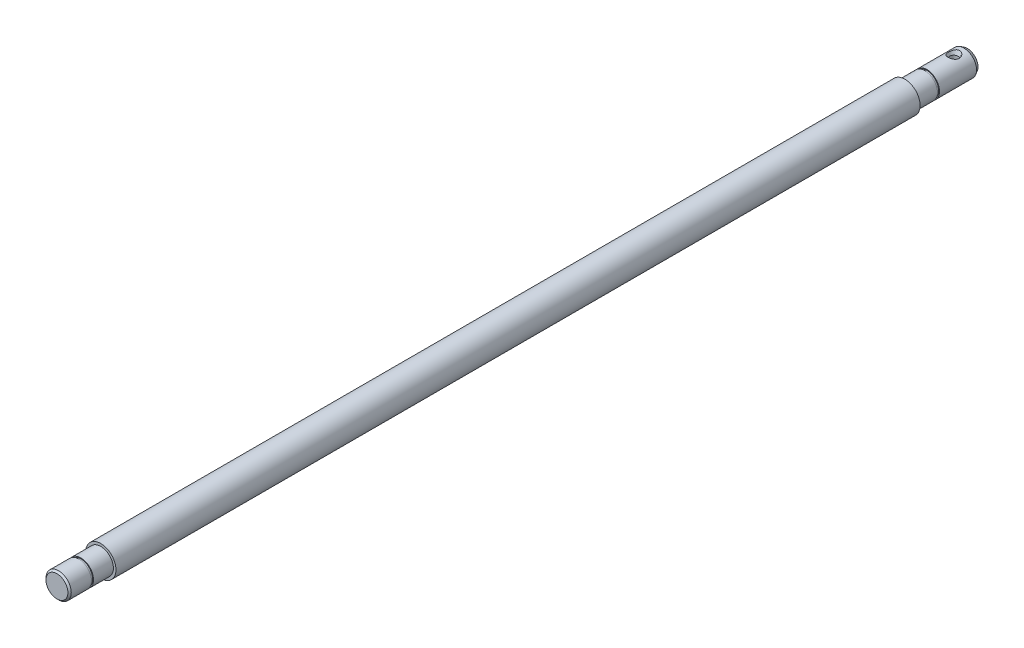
ISO-10303-21;
HEADER;
FILE_DESCRIPTION(('STEP AP214'),'2;1');
FILE_NAME('part.step','',(''),(''),'','','');
FILE_SCHEMA(('AUTOMOTIVE_DESIGN { 1 0 10303 214 1 1 1 1 }'));
ENDSEC;
DATA;
#1=APPLICATION_CONTEXT('core data for automotive mechanical design processes');
#2=APPLICATION_PROTOCOL_DEFINITION('international standard','automotive_design',2000,#1);
#3=PRODUCT_CONTEXT('',#1,'mechanical');
#4=PRODUCT('Part','Part','',(#3));
#5=PRODUCT_RELATED_PRODUCT_CATEGORY('part','',(#4));
#6=PRODUCT_DEFINITION_FORMATION('','',#4);
#7=PRODUCT_DEFINITION_CONTEXT('part definition',#1,'design');
#8=PRODUCT_DEFINITION('design','',#6,#7);
#9=PRODUCT_DEFINITION_SHAPE('','',#8);
#10=(LENGTH_UNIT() NAMED_UNIT(*) SI_UNIT(.MILLI.,.METRE.));
#11=(NAMED_UNIT(*) PLANE_ANGLE_UNIT() SI_UNIT($,.RADIAN.));
#12=(NAMED_UNIT(*) SI_UNIT($,.STERADIAN.) SOLID_ANGLE_UNIT());
#13=UNCERTAINTY_MEASURE_WITH_UNIT(LENGTH_MEASURE(1.E-05),#10,'distance_accuracy_value','');
#14=(GEOMETRIC_REPRESENTATION_CONTEXT(3) GLOBAL_UNCERTAINTY_ASSIGNED_CONTEXT((#13)) GLOBAL_UNIT_ASSIGNED_CONTEXT((#10,
#11,#12)) REPRESENTATION_CONTEXT('',''));
#15=CARTESIAN_POINT('',(0.,0.,0.));
#16=DIRECTION('',(0.,0.,1.));
#17=DIRECTION('',(1.,0.,0.));
#18=AXIS2_PLACEMENT_3D('',#15,#16,#17);
#19=CARTESIAN_POINT('',(0.,0.,540.));
#20=DIRECTION('',(0.,0.,-1.));
#21=DIRECTION('',(-1.,0.,0.));
#22=AXIS2_PLACEMENT_3D('',#19,#20,#21);
#23=CYLINDRICAL_SURFACE('',#22,7.5);
#24=CARTESIAN_POINT('',(0.,0.,37.));
#25=DIRECTION('',(0.,0.,-1.));
#26=DIRECTION('',(-1.,0.,0.));
#27=AXIS2_PLACEMENT_3D('',#24,#25,#26);
#28=CIRCLE('',#27,7.5);
#29=CARTESIAN_POINT('',(-7.5,0.,37.));
#30=VERTEX_POINT('',#29);
#31=EDGE_CURVE('E52',#30,#30,#28,.T.);
#32=ORIENTED_EDGE('',*,*,#31,.T.);
#33=EDGE_LOOP('',(#32));
#34=FACE_BOUND('',#33,.T.);
#35=CARTESIAN_POINT('',(0.,0.,25.2));
#36=DIRECTION('',(0.,0.,-1.));
#37=DIRECTION('',(-1.,0.,0.));
#38=AXIS2_PLACEMENT_3D('',#35,#36,#37);
#39=CIRCLE('',#38,7.5);
#40=CARTESIAN_POINT('',(-7.5,0.,25.2));
#41=VERTEX_POINT('',#40);
#42=EDGE_CURVE('E175',#41,#41,#39,.T.);
#43=ORIENTED_EDGE('',*,*,#42,.F.);
#44=EDGE_LOOP('',(#43));
#45=FACE_BOUND('',#44,.T.);
#46=ADVANCED_FACE('F34',(#34,#45),#23,.T.);
#47=CARTESIAN_POINT('',(0.,0.,2.));
#48=DIRECTION('',(0.,0.,1.));
#49=DIRECTION('',(1.,0.,0.));
#50=AXIS2_PLACEMENT_3D('',#47,#48,#49);
#51=CIRCLE('',#50,7.5);
#52=CARTESIAN_POINT('',(7.5,0.,2.));
#53=VERTEX_POINT('',#52);
#54=EDGE_CURVE('E166',#53,#53,#51,.T.);
#55=ORIENTED_EDGE('',*,*,#54,.T.);
#56=EDGE_LOOP('',(#55));
#57=FACE_BOUND('',#56,.T.);
#58=CARTESIAN_POINT('',(-2.37306753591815,-7.11467190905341,5.64909261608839));
#59=CARTESIAN_POINT('',(-2.50121158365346,-7.07193088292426,5.80360555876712));
#60=CARTESIAN_POINT('',(-2.6158120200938,-7.02986523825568,5.96956594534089));
#61=CARTESIAN_POINT('',(-2.81591307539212,-6.95213613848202,6.31953074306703));
#62=CARTESIAN_POINT('',(-2.90141119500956,-6.91647323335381,6.50353670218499));
#63=CARTESIAN_POINT('',(-3.04098717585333,-6.85624986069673,6.88315832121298));
#64=CARTESIAN_POINT('',(-3.09530860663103,-6.83160366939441,7.07867044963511));
#65=CARTESIAN_POINT('',(-3.17208576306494,-6.79630034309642,7.47702752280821));
#66=CARTESIAN_POINT('',(-3.19455717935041,-6.78563632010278,7.67986880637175));
#67=CARTESIAN_POINT('',(-3.20679414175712,-6.77986041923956,8.08112233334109));
#68=CARTESIAN_POINT('',(-3.1974472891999,-6.78432645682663,8.27950186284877));
#69=CARTESIAN_POINT('',(-3.14829126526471,-6.80727397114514,8.671622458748));
#70=CARTESIAN_POINT('',(-3.10847828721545,-6.82575719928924,8.86536294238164));
#71=CARTESIAN_POINT('',(-2.99998724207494,-6.87412053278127,9.24111950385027));
#72=CARTESIAN_POINT('',(-2.93157227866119,-6.90389653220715,9.42322543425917));
#73=CARTESIAN_POINT('',(-2.76736656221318,-6.97133665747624,9.77312274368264));
#74=CARTESIAN_POINT('',(-2.67156566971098,-7.00900370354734,9.94090879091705));
#75=CARTESIAN_POINT('',(-2.45019952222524,-7.08949046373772,10.2637537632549));
#76=CARTESIAN_POINT('',(-2.32367261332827,-7.13244837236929,10.4181214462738));
#77=CARTESIAN_POINT('',(-2.04493399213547,-7.21729993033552,10.7021343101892));
#78=CARTESIAN_POINT('',(-1.89272280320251,-7.25919360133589,10.8317799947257));
#79=CARTESIAN_POINT('',(-1.57132075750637,-7.33534097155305,11.0569693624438));
#80=CARTESIAN_POINT('',(-1.40291512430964,-7.3698115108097,11.1535518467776));
#81=CARTESIAN_POINT('',(-1.04938107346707,-7.42837229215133,11.313510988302));
#82=CARTESIAN_POINT('',(-0.864275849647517,-7.45247667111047,11.3769328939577));
#83=CARTESIAN_POINT('',(-0.508927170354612,-7.48455525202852,11.4604997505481));
#84=CARTESIAN_POINT('',(-0.339910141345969,-7.49422789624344,11.485223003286));
#85=CARTESIAN_POINT('',(8.58694290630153E-05,-7.50192226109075,11.5049269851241));
#86=CARTESIAN_POINT('',(0.171063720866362,-7.49995038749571,11.4999240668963));
#87=CARTESIAN_POINT('',(0.493511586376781,-7.48532783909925,11.4623484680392));
#88=CARTESIAN_POINT('',(0.645336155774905,-7.47366979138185,11.4323377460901));
#89=CARTESIAN_POINT('',(0.941719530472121,-7.44213572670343,11.34956667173));
#90=CARTESIAN_POINT('',(1.08627758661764,-7.42225886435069,11.296803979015));
#91=CARTESIAN_POINT('',(1.36989431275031,-7.37528303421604,11.168505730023));
#92=CARTESIAN_POINT('',(1.50857823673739,-7.34795371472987,11.0922314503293));
#93=CARTESIAN_POINT('',(1.77235436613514,-7.28883149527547,10.9204083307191));
#94=CARTESIAN_POINT('',(1.89744091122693,-7.25703674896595,10.8248515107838));
#95=CARTESIAN_POINT('',(2.14650497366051,-7.18757188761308,10.6046114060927));
#96=CARTESIAN_POINT('',(2.26853757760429,-7.14965517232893,10.4778068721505));
#97=CARTESIAN_POINT('',(2.49185161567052,-7.07492548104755,10.2067644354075));
#98=CARTESIAN_POINT('',(2.5931206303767,-7.03811317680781,10.0625161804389));
#99=CARTESIAN_POINT('',(2.78353264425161,-6.96516210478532,9.74306161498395));
#100=CARTESIAN_POINT('',(2.87010603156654,-6.9295455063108,9.56619556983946));
#101=CARTESIAN_POINT('',(3.01432345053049,-6.86804448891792,9.19944803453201));
#102=CARTESIAN_POINT('',(3.0719680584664,-6.84215987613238,9.00956680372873));
#103=CARTESIAN_POINT('',(3.15757501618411,-6.80308819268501,8.61877759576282));
#104=CARTESIAN_POINT('',(3.18506185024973,-6.79010483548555,8.4177440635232));
#105=CARTESIAN_POINT('',(3.20786524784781,-6.77936394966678,8.01348346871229));
#106=CARTESIAN_POINT('',(3.2031889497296,-6.78160304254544,7.81025690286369));
#107=CARTESIAN_POINT('',(3.16256416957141,-6.8006350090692,7.41481296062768));
#108=CARTESIAN_POINT('',(3.12770147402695,-6.8169224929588,7.2224577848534));
#109=CARTESIAN_POINT('',(3.02912924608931,-6.86128775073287,6.84670045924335));
#110=CARTESIAN_POINT('',(2.96541290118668,-6.88936830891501,6.66330043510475));
#111=CARTESIAN_POINT('',(2.80910426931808,-6.95458173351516,6.30679167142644));
#112=CARTESIAN_POINT('',(2.71599528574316,-6.99187375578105,6.13393886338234));
#113=CARTESIAN_POINT('',(2.50294163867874,-7.07093881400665,5.80667042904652));
#114=CARTESIAN_POINT('',(2.38298609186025,-7.11271366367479,5.65226231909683));
#115=CARTESIAN_POINT('',(2.11524580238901,-7.1969305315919,5.3633289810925));
#116=CARTESIAN_POINT('',(1.96692109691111,-7.23936772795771,5.22929920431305));
#117=CARTESIAN_POINT('',(1.64702623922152,-7.31877036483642,4.99051652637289));
#118=CARTESIAN_POINT('',(1.47547249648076,-7.35573962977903,4.88574311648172));
#119=CARTESIAN_POINT('',(1.12883644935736,-7.41645875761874,4.71849516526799));
#120=CARTESIAN_POINT('',(0.955300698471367,-7.4410666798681,4.65317686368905));
#121=CARTESIAN_POINT('',(0.68754521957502,-7.46896259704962,4.58005309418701));
#122=CARTESIAN_POINT('',(0.597046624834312,-7.47675874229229,4.55982038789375));
#123=CARTESIAN_POINT('',(0.414341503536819,-7.4891055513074,4.52791939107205));
#124=CARTESIAN_POINT('',(0.322135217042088,-7.49365666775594,4.51624990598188));
#125=CARTESIAN_POINT('',(0.0689826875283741,-7.50139363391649,4.49641107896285));
#126=CARTESIAN_POINT('',(-0.0928611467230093,-7.50113984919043,4.49706089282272));
#127=CARTESIAN_POINT('',(-0.413779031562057,-7.49030156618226,4.52485218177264));
#128=CARTESIAN_POINT('',(-0.572853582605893,-7.4797189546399,4.55198881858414));
#129=CARTESIAN_POINT('',(-0.877468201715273,-7.45000319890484,4.62965991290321));
#130=CARTESIAN_POINT('',(-1.02329502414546,-7.43122781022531,4.67921829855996));
#131=CARTESIAN_POINT('',(-1.30495390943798,-7.38697913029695,4.79922428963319));
#132=CARTESIAN_POINT('',(-1.44078252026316,-7.361503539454,4.86967906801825));
#133=CARTESIAN_POINT('',(-1.72287734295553,-7.30109502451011,5.0430467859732));
#134=CARTESIAN_POINT('',(-1.86678945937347,-7.26528696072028,5.1494865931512));
#135=CARTESIAN_POINT('',(-2.1350563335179,-7.19103450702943,5.3839643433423));
#136=CARTESIAN_POINT('',(-2.25939098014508,-7.15258746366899,5.51202421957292));
#137=CARTESIAN_POINT('',(-2.37306753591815,-7.11467190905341,5.64909261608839));
#138=B_SPLINE_CURVE_WITH_KNOTS('',3,(#58,#59,#60,#61,#62,#63,#64,#65,#66,#67,#68,#69,#70,#71,
#72,#73,#74,#75,#76,#77,#78,#79,#80,#81,#82,#83,#84,#85,#86,#87,#88,#89,#90,#91,#92,#93,#94,#95,
#96,#97,#98,#99,#100,#101,#102,#103,#104,#105,#106,#107,#108,#109,#110,#111,#112,#113,#114,#115,
#116,#117,#118,#119,#120,#121,#122,#123,#124,#125,#126,#127,#128,#129,#130,#131,#132,#133,#134,
#135,#136,#137),.UNSPECIFIED.,.T.,.F.,(4,2,2,2,2,2,2,2,2,2,2,2,2,2,2,2,2,2,2,2,2,2,2,2,2,2,2,2,
2,2,2,2,2,2,2,2,2,2,2,4),(0.,0.615035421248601,1.23012364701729,1.84033865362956,
2.45025293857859,3.04329410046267,3.63640937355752,4.22418474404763,4.81217801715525,
5.4217075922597,6.03122474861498,6.61931015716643,7.20659099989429,7.71699522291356,
8.22711869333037,8.69061171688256,9.15415242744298,9.63407044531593,10.1141874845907,
10.6520815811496,11.190296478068,11.7878774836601,12.385446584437,12.9923082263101,
13.5990351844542,14.1848045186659,14.7707122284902,15.3675542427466,15.9646386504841,
16.5744836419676,17.1839000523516,17.7413829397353,18.0201527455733,18.2988836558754,
18.7817032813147,19.2644347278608,19.7279184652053,20.1915614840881,20.7366029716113,
21.2822007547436),.UNSPECIFIED.);
#139=CARTESIAN_POINT('',(-2.37306753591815,-7.11467190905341,5.64909261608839));
#140=VERTEX_POINT('',#139);
#141=EDGE_CURVE('E49',#140,#140,#138,.T.);
#142=ORIENTED_EDGE('',*,*,#141,.T.);
#143=EDGE_LOOP('',(#142));
#144=FACE_BOUND('',#143,.T.);
#145=CARTESIAN_POINT('',(-2.37306753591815,7.11467190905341,5.64909261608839));
#146=CARTESIAN_POINT('',(-2.24488078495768,7.15742863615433,5.49454331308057));
#147=CARTESIAN_POINT('',(-2.10290799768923,7.20093586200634,5.35117163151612));
#148=CARTESIAN_POINT('',(-1.79373474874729,7.28409692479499,5.09226600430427));
#149=CARTESIAN_POINT('',(-1.62647474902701,7.32374129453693,4.97679947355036));
#150=CARTESIAN_POINT('',(-1.36703329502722,7.37483905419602,4.83301825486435));
#151=CARTESIAN_POINT('',(-1.28286151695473,7.3899858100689,4.79123326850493));
#152=CARTESIAN_POINT('',(-1.11069652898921,7.41781213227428,4.71549018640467));
#153=CARTESIAN_POINT('',(-1.02270546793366,7.43049306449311,4.68152775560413));
#154=CARTESIAN_POINT('',(-0.843705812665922,7.45293762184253,4.62199137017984));
#155=CARTESIAN_POINT('',(-0.752701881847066,7.46270554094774,4.59640506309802));
#156=CARTESIAN_POINT('',(-0.568428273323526,7.4790016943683,4.55398480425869));
#157=CARTESIAN_POINT('',(-0.475158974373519,7.48553046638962,4.5371493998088));
#158=CARTESIAN_POINT('',(-0.218867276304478,7.49855715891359,4.50362861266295));
#159=CARTESIAN_POINT('',(-0.0543784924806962,7.50158944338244,4.49593105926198));
#160=CARTESIAN_POINT('',(0.273303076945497,7.49681287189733,4.50815531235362));
#161=CARTESIAN_POINT('',(0.436496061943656,7.48900571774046,4.52807278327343));
#162=CARTESIAN_POINT('',(0.747114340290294,7.46422643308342,4.59236861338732));
#163=CARTESIAN_POINT('',(0.894902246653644,7.44782106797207,4.63523749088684));
#164=CARTESIAN_POINT('',(1.18138730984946,7.40778466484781,4.74243225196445));
#165=CARTESIAN_POINT('',(1.32008292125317,7.38415240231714,4.80676177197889));
#166=CARTESIAN_POINT('',(1.59464002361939,7.3299385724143,4.95941645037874));
#167=CARTESIAN_POINT('',(1.72969749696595,7.29899899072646,5.04905443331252));
#168=CARTESIAN_POINT('',(1.98440380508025,7.23391026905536,5.24706708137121));
#169=CARTESIAN_POINT('',(2.10404487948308,7.19975952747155,5.35545111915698));
#170=CARTESIAN_POINT('',(2.34071164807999,7.12659254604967,5.6031264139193));
#171=CARTESIAN_POINT('',(2.45543881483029,7.08751346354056,5.74459836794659));
#172=CARTESIAN_POINT('',(2.66186356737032,7.01260059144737,6.04425859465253));
#173=CARTESIAN_POINT('',(2.75354914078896,6.97676850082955,6.20245552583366));
#174=CARTESIAN_POINT('',(2.91959464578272,6.90903376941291,6.54677937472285));
#175=CARTESIAN_POINT('',(2.99167563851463,6.87776795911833,6.73413889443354));
#176=CARTESIAN_POINT('',(3.10515375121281,6.82729210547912,7.1194610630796));
#177=CARTESIAN_POINT('',(3.14655764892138,6.80807939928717,7.31742135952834));
#178=CARTESIAN_POINT('',(3.19727248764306,6.78441186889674,7.71635184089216));
#179=CARTESIAN_POINT('',(3.20688978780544,6.77981618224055,7.91727443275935));
#180=CARTESIAN_POINT('',(3.19457781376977,6.78562566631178,8.31791478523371));
#181=CARTESIAN_POINT('',(3.1726508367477,6.79602974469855,8.51763263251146));
#182=CARTESIAN_POINT('',(3.09892200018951,6.82995196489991,8.90482941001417));
#183=CARTESIAN_POINT('',(3.04791361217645,6.85312127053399,9.09249165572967));
#184=CARTESIAN_POINT('',(2.91789035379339,6.90947961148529,9.45627727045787));
#185=CARTESIAN_POINT('',(2.8388668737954,6.94267172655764,9.63239707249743));
#186=CARTESIAN_POINT('',(2.65137653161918,7.01645560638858,9.97414422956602));
#187=CARTESIAN_POINT('',(2.54205010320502,7.05724980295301,10.1392569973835));
#188=CARTESIAN_POINT('',(2.2969379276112,7.14078509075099,10.4481119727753));
#189=CARTESIAN_POINT('',(2.16114452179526,7.1835267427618,10.5918479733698));
#190=CARTESIAN_POINT('',(1.86560786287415,7.26587689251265,10.8528169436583));
#191=CARTESIAN_POINT('',(1.70590917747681,7.30549101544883,10.970098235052));
#192=CARTESIAN_POINT('',(1.36590222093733,7.37660607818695,11.1730116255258));
#193=CARTESIAN_POINT('',(1.18561727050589,7.40811606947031,11.2586790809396));
#194=CARTESIAN_POINT('',(0.831186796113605,7.45569738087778,11.385599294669));
#195=CARTESIAN_POINT('',(0.658624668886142,7.47310489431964,11.4307588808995));
#196=CARTESIAN_POINT('',(0.30744750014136,7.49575293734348,11.4892323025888));
#197=CARTESIAN_POINT('',(0.12883818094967,7.5010046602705,11.502575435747));
#198=CARTESIAN_POINT('',(-0.206482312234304,7.49880851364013,11.4969475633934));
#199=CARTESIAN_POINT('',(-0.363278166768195,7.49279301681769,11.4816215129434));
#200=CARTESIAN_POINT('',(-0.671812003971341,7.47145064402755,11.42645036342));
#201=CARTESIAN_POINT('',(-0.823550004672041,7.45612380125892,11.3866053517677));
#202=CARTESIAN_POINT('',(-1.11762451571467,7.41774057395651,11.2844599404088));
#203=CARTESIAN_POINT('',(-1.25998806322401,7.39470769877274,11.2222277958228));
#204=CARTESIAN_POINT('',(-1.53300828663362,7.34297093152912,11.0777546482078));
#205=CARTESIAN_POINT('',(-1.66366127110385,7.31426526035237,10.9955073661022));
#206=CARTESIAN_POINT('',(-1.92411120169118,7.25035161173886,10.8041374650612));
#207=CARTESIAN_POINT('',(-2.05241908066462,7.21477813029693,10.6931139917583));
#208=CARTESIAN_POINT('',(-2.2906187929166,7.1427293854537,10.4530534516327));
#209=CARTESIAN_POINT('',(-2.40049963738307,7.10625359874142,10.3240057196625));
#210=CARTESIAN_POINT('',(-2.61298434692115,7.03111378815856,10.0338250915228));
#211=CARTESIAN_POINT('',(-2.71297829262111,6.99274286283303,9.87069786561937));
#212=CARTESIAN_POINT('',(-2.88637925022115,6.92297469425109,9.52947345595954));
#213=CARTESIAN_POINT('',(-2.95977932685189,6.89157927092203,9.3513723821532));
#214=CARTESIAN_POINT('',(-3.08130964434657,6.83814242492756,8.97582394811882));
#215=CARTESIAN_POINT('',(-3.12808214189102,6.81661302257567,8.77786010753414));
#216=CARTESIAN_POINT('',(-3.18946153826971,6.78811563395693,8.37604304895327));
#217=CARTESIAN_POINT('',(-3.20408320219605,6.78114096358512,8.1721925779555));
#218=CARTESIAN_POINT('',(-3.20079336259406,6.78269173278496,7.77157002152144));
#219=CARTESIAN_POINT('',(-3.18393915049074,6.7907134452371,7.57478626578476));
#220=CARTESIAN_POINT('',(-3.12024216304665,6.82021223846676,7.18701961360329));
#221=CARTESIAN_POINT('',(-3.0733740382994,6.84170069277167,6.99604176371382));
#222=CARTESIAN_POINT('',(-2.9508757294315,6.89541744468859,6.62517447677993));
#223=CARTESIAN_POINT('',(-2.87523753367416,6.92764873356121,6.44528814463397));
#224=CARTESIAN_POINT('',(-2.69684981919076,6.99901069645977,6.10142151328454));
#225=CARTESIAN_POINT('',(-2.59417093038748,7.03812330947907,5.93740127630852));
#226=CARTESIAN_POINT('',(-2.4447641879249,7.09044713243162,5.73777626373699));
#227=CARTESIAN_POINT('',(-2.409471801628,7.10252925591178,5.69298368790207));
#228=CARTESIAN_POINT('',(-2.37306753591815,7.11467190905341,5.64909261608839));
#229=B_SPLINE_CURVE_WITH_KNOTS('',3,(#145,#146,#147,#148,#149,#150,#151,#152,#153,#154,#155,
#156,#157,#158,#159,#160,#161,#162,#163,#164,#165,#166,#167,#168,#169,#170,#171,#172,#173,#174,
#175,#176,#177,#178,#179,#180,#181,#182,#183,#184,#185,#186,#187,#188,#189,#190,#191,#192,#193,
#194,#195,#196,#197,#198,#199,#200,#201,#202,#203,#204,#205,#206,#207,#208,#209,#210,#211,#212,
#213,#214,#215,#216,#217,#218,#219,#220,#221,#222,#223,#224,#225,#226,#227,#228),.UNSPECIFIED.,
.T.,.F.,(4,2,2,2,2,2,2,2,2,2,2,2,2,2,2,2,2,2,2,2,2,2,2,2,2,2,2,2,2,2,2,2,2,2,2,2,2,2,2,2,2,4),
(0.,0.615711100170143,1.23289512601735,1.51809575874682,1.80313795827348,2.08775788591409,
2.37233055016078,2.8635651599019,3.35472265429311,3.81695761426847,4.27927093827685,
4.77237590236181,5.26572812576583,5.82228223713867,6.37912590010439,6.98570583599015,
7.59215171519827,8.1927353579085,8.79327526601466,9.37816431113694,9.96323326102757,
10.566983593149,11.1709088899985,11.7737219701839,12.3758588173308,12.9103892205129,
13.4444272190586,13.9151249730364,14.3858210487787,14.8550940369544,15.3245144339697,
15.8425346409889,16.3608626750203,16.9437338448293,17.5267569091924,18.1373255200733,
18.7476136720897,19.3377696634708,19.9284247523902,20.5192444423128,21.1085359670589,
21.2833942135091),.UNSPECIFIED.);
#230=CARTESIAN_POINT('',(-2.37306753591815,7.11467190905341,5.64909261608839));
#231=VERTEX_POINT('',#230);
#232=EDGE_CURVE('E45',#231,#231,#229,.T.);
#233=ORIENTED_EDGE('',*,*,#232,.T.);
#234=EDGE_LOOP('',(#233));
#235=FACE_BOUND('',#234,.T.);
#236=CARTESIAN_POINT('',(0.,0.,24.));
#237=DIRECTION('',(0.,0.,-1.));
#238=DIRECTION('',(-1.,0.,0.));
#239=AXIS2_PLACEMENT_3D('',#236,#237,#238);
#240=CIRCLE('',#239,7.5);
#241=CARTESIAN_POINT('',(-7.5,0.,24.));
#242=VERTEX_POINT('',#241);
#243=EDGE_CURVE('E55',#242,#242,#240,.T.);
#244=ORIENTED_EDGE('',*,*,#243,.T.);
#245=EDGE_LOOP('',(#244));
#246=FACE_BOUND('',#245,.T.);
#247=ADVANCED_FACE('F88',(#57,#144,#235,#246),#23,.T.);
#248=CARTESIAN_POINT('',(0.,0.,0.));
#249=DIRECTION('',(0.,0.,1.));
#250=DIRECTION('',(1.,0.,0.));
#251=AXIS2_PLACEMENT_3D('',#248,#249,#250);
#252=PLANE('',#251);
#253=CARTESIAN_POINT('',(0.,0.,0.));
#254=DIRECTION('',(0.,0.,1.));
#255=DIRECTION('',(1.,0.,0.));
#256=AXIS2_PLACEMENT_3D('',#253,#254,#255);
#257=CIRCLE('',#256,6.34529946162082);
#258=CARTESIAN_POINT('',(6.34529946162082,0.,0.));
#259=VERTEX_POINT('',#258);
#260=EDGE_CURVE('E165',#259,#259,#257,.F.);
#261=ORIENTED_EDGE('',*,*,#260,.T.);
#262=EDGE_LOOP('',(#261));
#263=FACE_BOUND('',#262,.T.);
#264=ADVANCED_FACE('F86',(#263),#252,.F.);
#265=CARTESIAN_POINT('',(0.,0.,2.));
#266=DIRECTION('',(0.,0.,1.));
#267=DIRECTION('',(1.,0.,0.));
#268=AXIS2_PLACEMENT_3D('',#265,#266,#267);
#269=CONICAL_SURFACE('',#268,7.5,0.52359877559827);
#270=ORIENTED_EDGE('',*,*,#260,.F.);
#271=EDGE_LOOP('',(#270));
#272=FACE_BOUND('',#271,.T.);
#273=ORIENTED_EDGE('',*,*,#54,.F.);
#274=EDGE_LOOP('',(#273));
#275=FACE_BOUND('',#274,.T.);
#276=ADVANCED_FACE('F79',(#272,#275),#269,.T.);
#277=CARTESIAN_POINT('',(0.,7.5,8.));
#278=DIRECTION('',(0.,1.,0.));
#279=DIRECTION('',(0.,0.,1.));
#280=AXIS2_PLACEMENT_3D('',#277,#278,#279);
#281=CONICAL_SURFACE('',#280,3.5,0.392699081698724);
#282=CARTESIAN_POINT('',(0.,5.0857864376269,8.));
#283=DIRECTION('',(0.,1.,0.));
#284=DIRECTION('',(0.,0.,1.));
#285=AXIS2_PLACEMENT_3D('',#282,#283,#284);
#286=CIRCLE('',#285,2.5);
#287=CARTESIAN_POINT('',(0.,5.0857864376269,10.5));
#288=VERTEX_POINT('',#287);
#289=EDGE_CURVE('E169',#288,#288,#286,.T.);
#290=ORIENTED_EDGE('',*,*,#289,.F.);
#291=EDGE_LOOP('',(#290));
#292=FACE_BOUND('',#291,.T.);
#293=ORIENTED_EDGE('',*,*,#232,.F.);
#294=EDGE_LOOP('',(#293));
#295=FACE_BOUND('',#294,.T.);
#296=ADVANCED_FACE('F73',(#292,#295),#281,.F.);
#297=CARTESIAN_POINT('',(0.,-5.08578643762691,8.));
#298=DIRECTION('',(0.,-1.,0.));
#299=DIRECTION('',(0.,0.,-1.));
#300=AXIS2_PLACEMENT_3D('',#297,#298,#299);
#301=CONICAL_SURFACE('',#300,2.5,0.392699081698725);
#302=CARTESIAN_POINT('',(0.,-5.08578643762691,8.));
#303=DIRECTION('',(0.,1.,0.));
#304=DIRECTION('',(0.,0.,1.));
#305=AXIS2_PLACEMENT_3D('',#302,#303,#304);
#306=CIRCLE('',#305,2.5);
#307=CARTESIAN_POINT('',(0.,-5.08578643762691,10.5));
#308=VERTEX_POINT('',#307);
#309=EDGE_CURVE('E161',#308,#308,#306,.T.);
#310=ORIENTED_EDGE('',*,*,#309,.T.);
#311=EDGE_LOOP('',(#310));
#312=FACE_BOUND('',#311,.T.);
#313=ORIENTED_EDGE('',*,*,#141,.F.);
#314=EDGE_LOOP('',(#313));
#315=FACE_BOUND('',#314,.T.);
#316=ADVANCED_FACE('F78',(#312,#315),#301,.F.);
#317=CARTESIAN_POINT('',(0.,7.5,8.));
#318=DIRECTION('',(0.,1.,0.));
#319=DIRECTION('',(0.,0.,1.));
#320=AXIS2_PLACEMENT_3D('',#317,#318,#319);
#321=CYLINDRICAL_SURFACE('',#320,2.5);
#322=ORIENTED_EDGE('',*,*,#309,.F.);
#323=EDGE_LOOP('',(#322));
#324=FACE_BOUND('',#323,.T.);
#325=ORIENTED_EDGE('',*,*,#289,.T.);
#326=EDGE_LOOP('',(#325));
#327=FACE_BOUND('',#326,.T.);
#328=ADVANCED_FACE('F81',(#324,#327),#321,.F.);
#329=CARTESIAN_POINT('',(7.5,0.,25.2));
#330=DIRECTION('',(0.,0.,-1.));
#331=DIRECTION('',(-1.,0.,0.));
#332=AXIS2_PLACEMENT_3D('',#329,#330,#331);
#333=PLANE('',#332);
#334=ORIENTED_EDGE('',*,*,#42,.T.);
#335=EDGE_LOOP('',(#334));
#336=FACE_BOUND('',#335,.T.);
#337=CARTESIAN_POINT('',(0.,0.,25.2));
#338=DIRECTION('',(0.,0.,-1.));
#339=DIRECTION('',(-1.,0.,0.));
#340=AXIS2_PLACEMENT_3D('',#337,#338,#339);
#341=CIRCLE('',#340,7.);
#342=CARTESIAN_POINT('',(-7.,0.,25.2));
#343=VERTEX_POINT('',#342);
#344=EDGE_CURVE('E178',#343,#343,#341,.T.);
#345=ORIENTED_EDGE('',*,*,#344,.F.);
#346=EDGE_LOOP('',(#345));
#347=FACE_BOUND('',#346,.T.);
#348=ADVANCED_FACE('F147',(#336,#347),#333,.T.);
#349=CARTESIAN_POINT('',(0.,0.,0.));
#350=DIRECTION('',(0.,0.,-1.));
#351=DIRECTION('',(-1.,0.,0.));
#352=AXIS2_PLACEMENT_3D('',#349,#350,#351);
#353=CYLINDRICAL_SURFACE('',#352,7.);
#354=ORIENTED_EDGE('',*,*,#344,.T.);
#355=EDGE_LOOP('',(#354));
#356=FACE_BOUND('',#355,.T.);
#357=CARTESIAN_POINT('',(0.,0.,24.));
#358=DIRECTION('',(0.,0.,-1.));
#359=DIRECTION('',(-1.,0.,0.));
#360=AXIS2_PLACEMENT_3D('',#357,#358,#359);
#361=CIRCLE('',#360,7.);
#362=CARTESIAN_POINT('',(-7.,0.,24.));
#363=VERTEX_POINT('',#362);
#364=EDGE_CURVE('E181',#363,#363,#361,.T.);
#365=ORIENTED_EDGE('',*,*,#364,.F.);
#366=EDGE_LOOP('',(#365));
#367=FACE_BOUND('',#366,.T.);
#368=ADVANCED_FACE('F143',(#356,#367),#353,.T.);
#369=CARTESIAN_POINT('',(7.5,0.,24.));
#370=DIRECTION('',(0.,0.,1.));
#371=DIRECTION('',(1.,0.,0.));
#372=AXIS2_PLACEMENT_3D('',#369,#370,#371);
#373=PLANE('',#372);
#374=ORIENTED_EDGE('',*,*,#364,.T.);
#375=EDGE_LOOP('',(#374));
#376=FACE_BOUND('',#375,.T.);
#377=ORIENTED_EDGE('',*,*,#243,.F.);
#378=EDGE_LOOP('',(#377));
#379=FACE_BOUND('',#378,.T.);
#380=ADVANCED_FACE('F135',(#376,#379),#373,.T.);
#381=CARTESIAN_POINT('',(0.,0.,37.));
#382=DIRECTION('',(0.,0.,-1.));
#383=DIRECTION('',(-1.,0.,0.));
#384=AXIS2_PLACEMENT_3D('',#381,#382,#383);
#385=PLANE('',#384);
#386=CARTESIAN_POINT('',(0.,0.,37.));
#387=DIRECTION('',(0.,0.,-1.));
#388=DIRECTION('',(-1.,0.,0.));
#389=AXIS2_PLACEMENT_3D('',#386,#387,#388);
#390=CIRCLE('',#389,9.);
#391=CARTESIAN_POINT('',(-9.,0.,37.));
#392=VERTEX_POINT('',#391);
#393=EDGE_CURVE('E58',#392,#392,#390,.F.);
#394=ORIENTED_EDGE('',*,*,#393,.F.);
#395=EDGE_LOOP('',(#394));
#396=FACE_BOUND('',#395,.T.);
#397=ORIENTED_EDGE('',*,*,#31,.F.);
#398=EDGE_LOOP('',(#397));
#399=FACE_BOUND('',#398,.T.);
#400=ADVANCED_FACE('F129',(#396,#399),#385,.T.);
#401=CARTESIAN_POINT('',(0.,0.,514.));
#402=DIRECTION('',(0.,0.,1.));
#403=DIRECTION('',(1.,0.,0.));
#404=AXIS2_PLACEMENT_3D('',#401,#402,#403);
#405=PLANE('',#404);
#406=CARTESIAN_POINT('',(0.,0.,514.));
#407=DIRECTION('',(0.,0.,1.));
#408=DIRECTION('',(1.,0.,0.));
#409=AXIS2_PLACEMENT_3D('',#406,#407,#408);
#410=CIRCLE('',#409,9.);
#411=CARTESIAN_POINT('',(9.,0.,514.));
#412=VERTEX_POINT('',#411);
#413=EDGE_CURVE('E188',#412,#412,#410,.T.);
#414=ORIENTED_EDGE('',*,*,#413,.T.);
#415=EDGE_LOOP('',(#414));
#416=FACE_BOUND('',#415,.T.);
#417=CARTESIAN_POINT('',(0.,0.,514.));
#418=DIRECTION('',(0.,0.,1.));
#419=DIRECTION('',(1.,0.,0.));
#420=AXIS2_PLACEMENT_3D('',#417,#418,#419);
#421=CIRCLE('',#420,7.5);
#422=CARTESIAN_POINT('',(7.5,0.,514.));
#423=VERTEX_POINT('',#422);
#424=EDGE_CURVE('E56',#423,#423,#421,.T.);
#425=ORIENTED_EDGE('',*,*,#424,.F.);
#426=EDGE_LOOP('',(#425));
#427=FACE_BOUND('',#426,.T.);
#428=ADVANCED_FACE('F119',(#416,#427),#405,.T.);
#429=CARTESIAN_POINT('',(0.,0.,11.5441558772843));
#430=DIRECTION('',(0.,0.,1.));
#431=DIRECTION('',(1.,0.,0.));
#432=AXIS2_PLACEMENT_3D('',#429,#430,#431);
#433=CYLINDRICAL_SURFACE('',#432,9.);
#434=ORIENTED_EDGE('',*,*,#413,.F.);
#435=EDGE_LOOP('',(#434));
#436=FACE_BOUND('',#435,.T.);
#437=ORIENTED_EDGE('',*,*,#393,.T.);
#438=EDGE_LOOP('',(#437));
#439=FACE_BOUND('',#438,.T.);
#440=ADVANCED_FACE('F110',(#436,#439),#433,.T.);
#441=CARTESIAN_POINT('',(0.,0.,525.8));
#442=DIRECTION('',(0.,0.,1.));
#443=DIRECTION('',(1.,0.,0.));
#444=AXIS2_PLACEMENT_3D('',#441,#442,#443);
#445=CIRCLE('',#444,7.5);
#446=CARTESIAN_POINT('',(7.5,0.,525.8));
#447=VERTEX_POINT('',#446);
#448=EDGE_CURVE('E125',#447,#447,#445,.T.);
#449=ORIENTED_EDGE('',*,*,#448,.F.);
#450=EDGE_LOOP('',(#449));
#451=FACE_BOUND('',#450,.T.);
#452=ORIENTED_EDGE('',*,*,#424,.T.);
#453=EDGE_LOOP('',(#452));
#454=FACE_BOUND('',#453,.T.);
#455=ADVANCED_FACE('F70',(#451,#454),#23,.T.);
#456=CARTESIAN_POINT('',(7.5,0.,527.));
#457=DIRECTION('',(0.,0.,1.));
#458=DIRECTION('',(1.,0.,0.));
#459=AXIS2_PLACEMENT_3D('',#456,#457,#458);
#460=PLANE('',#459);
#461=CARTESIAN_POINT('',(0.,0.,527.));
#462=DIRECTION('',(0.,0.,1.));
#463=DIRECTION('',(1.,0.,0.));
#464=AXIS2_PLACEMENT_3D('',#461,#462,#463);
#465=CIRCLE('',#464,7.5);
#466=CARTESIAN_POINT('',(7.5,0.,527.));
#467=VERTEX_POINT('',#466);
#468=EDGE_CURVE('E190',#467,#467,#465,.T.);
#469=ORIENTED_EDGE('',*,*,#468,.F.);
#470=EDGE_LOOP('',(#469));
#471=FACE_BOUND('',#470,.T.);
#472=CARTESIAN_POINT('',(0.,0.,527.));
#473=DIRECTION('',(0.,0.,1.));
#474=DIRECTION('',(1.,0.,0.));
#475=AXIS2_PLACEMENT_3D('',#472,#473,#474);
#476=CIRCLE('',#475,7.);
#477=CARTESIAN_POINT('',(7.,0.,527.));
#478=VERTEX_POINT('',#477);
#479=EDGE_CURVE('E193',#478,#478,#476,.T.);
#480=ORIENTED_EDGE('',*,*,#479,.T.);
#481=EDGE_LOOP('',(#480));
#482=FACE_BOUND('',#481,.T.);
#483=ADVANCED_FACE('F109',(#471,#482),#460,.F.);
#484=CARTESIAN_POINT('',(0.,0.,539.85553826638));
#485=DIRECTION('',(0.,0.,1.));
#486=DIRECTION('',(1.,0.,0.));
#487=AXIS2_PLACEMENT_3D('',#484,#485,#486);
#488=CYLINDRICAL_SURFACE('',#487,7.);
#489=ORIENTED_EDGE('',*,*,#479,.F.);
#490=EDGE_LOOP('',(#489));
#491=FACE_BOUND('',#490,.T.);
#492=CARTESIAN_POINT('',(0.,0.,525.8));
#493=DIRECTION('',(0.,0.,1.));
#494=DIRECTION('',(1.,0.,0.));
#495=AXIS2_PLACEMENT_3D('',#492,#493,#494);
#496=CIRCLE('',#495,7.);
#497=CARTESIAN_POINT('',(7.,0.,525.8));
#498=VERTEX_POINT('',#497);
#499=EDGE_CURVE('E196',#498,#498,#496,.T.);
#500=ORIENTED_EDGE('',*,*,#499,.T.);
#501=EDGE_LOOP('',(#500));
#502=FACE_BOUND('',#501,.T.);
#503=ADVANCED_FACE('F116',(#491,#502),#488,.T.);
#504=CARTESIAN_POINT('',(7.5,0.,525.8));
#505=DIRECTION('',(0.,0.,-1.));
#506=DIRECTION('',(-1.,0.,0.));
#507=AXIS2_PLACEMENT_3D('',#504,#505,#506);
#508=PLANE('',#507);
#509=ORIENTED_EDGE('',*,*,#499,.F.);
#510=EDGE_LOOP('',(#509));
#511=FACE_BOUND('',#510,.T.);
#512=ORIENTED_EDGE('',*,*,#448,.T.);
#513=EDGE_LOOP('',(#512));
#514=FACE_BOUND('',#513,.T.);
#515=ADVANCED_FACE('F85',(#511,#514),#508,.F.);
#516=CARTESIAN_POINT('',(0.,0.,540.));
#517=DIRECTION('',(0.,0.,1.));
#518=DIRECTION('',(1.,0.,0.));
#519=AXIS2_PLACEMENT_3D('',#516,#517,#518);
#520=PLANE('',#519);
#521=CARTESIAN_POINT('',(0.,0.,540.));
#522=DIRECTION('',(0.,0.,1.));
#523=DIRECTION('',(1.,0.,0.));
#524=AXIS2_PLACEMENT_3D('',#521,#522,#523);
#525=CIRCLE('',#524,6.50000000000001);
#526=CARTESIAN_POINT('',(6.50000000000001,0.,540.));
#527=VERTEX_POINT('',#526);
#528=EDGE_CURVE('E41',#527,#527,#525,.T.);
#529=ORIENTED_EDGE('',*,*,#528,.T.);
#530=EDGE_LOOP('',(#529));
#531=FACE_BOUND('',#530,.T.);
#532=ADVANCED_FACE('F82',(#531),#520,.T.);
#533=CARTESIAN_POINT('',(0.,0.,539.));
#534=DIRECTION('',(0.,0.,1.));
#535=DIRECTION('',(1.,0.,0.));
#536=AXIS2_PLACEMENT_3D('',#533,#534,#535);
#537=CIRCLE('',#536,7.5);
#538=CARTESIAN_POINT('',(7.5,0.,539.));
#539=VERTEX_POINT('',#538);
#540=EDGE_CURVE('E10',#539,#539,#537,.F.);
#541=ORIENTED_EDGE('',*,*,#540,.T.);
#542=EDGE_LOOP('',(#541));
#543=FACE_BOUND('',#542,.T.);
#544=ORIENTED_EDGE('',*,*,#468,.T.);
#545=EDGE_LOOP('',(#544));
#546=FACE_BOUND('',#545,.T.);
#547=ADVANCED_FACE('F84',(#543,#546),#23,.T.);
#548=CARTESIAN_POINT('',(0.,0.,540.));
#549=DIRECTION('',(0.,0.,-1.));
#550=DIRECTION('',(-1.,0.,0.));
#551=AXIS2_PLACEMENT_3D('',#548,#549,#550);
#552=CONICAL_SURFACE('',#551,6.50000000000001,0.78539816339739);
#553=ORIENTED_EDGE('',*,*,#540,.F.);
#554=EDGE_LOOP('',(#553));
#555=FACE_BOUND('',#554,.T.);
#556=ORIENTED_EDGE('',*,*,#528,.F.);
#557=EDGE_LOOP('',(#556));
#558=FACE_BOUND('',#557,.T.);
#559=ADVANCED_FACE('F36',(#555,#558),#552,.T.);
#560=CLOSED_SHELL('',(#46,#247,#264,#276,#296,#316,#328,#348,#368,#380,#400,#428,#440,#455,#483,
#503,#515,#532,#547,#559));
#561=MANIFOLD_SOLID_BREP('B2',#560);
#562=ADVANCED_BREP_SHAPE_REPRESENTATION('',(#18,#561),#14);
#563=SHAPE_DEFINITION_REPRESENTATION(#9,#562);
ENDSEC;
END-ISO-10303-21;
